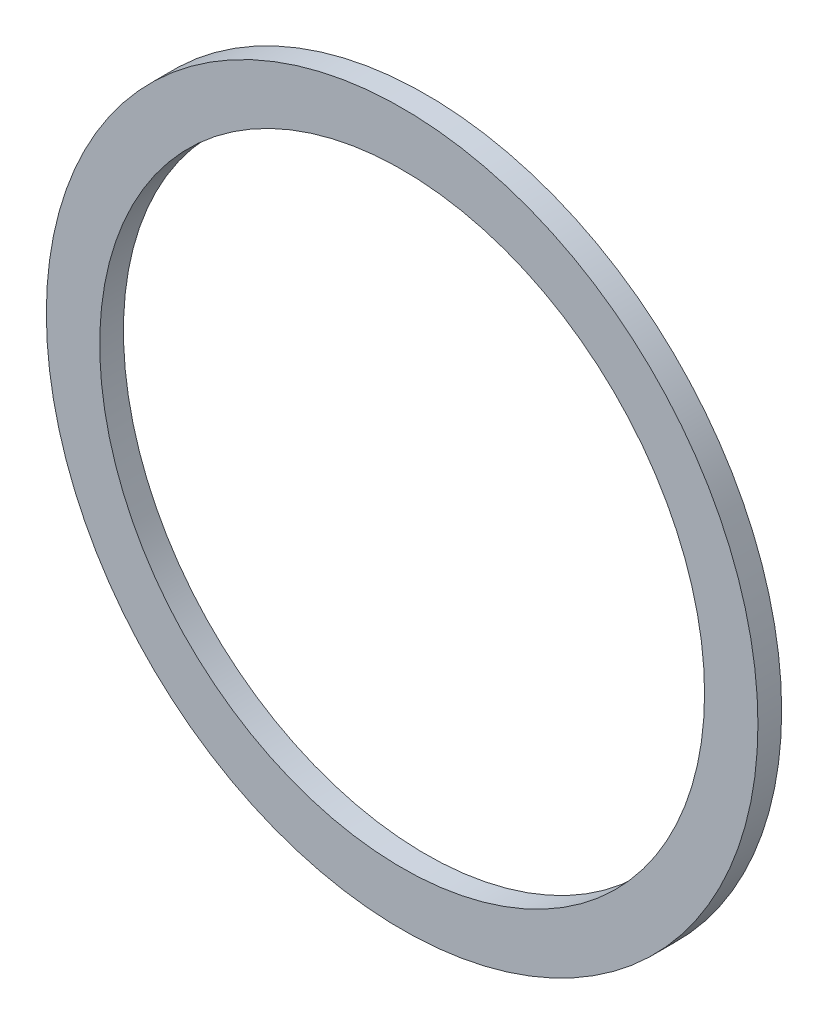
ISO-10303-21;
HEADER;
FILE_DESCRIPTION(('STEP AP214'),'2;1');
FILE_NAME('part.step','',(''),(''),'','','');
FILE_SCHEMA(('AUTOMOTIVE_DESIGN { 1 0 10303 214 1 1 1 1 }'));
ENDSEC;
DATA;
#1=APPLICATION_CONTEXT('core data for automotive mechanical design processes');
#2=APPLICATION_PROTOCOL_DEFINITION('international standard','automotive_design',2000,#1);
#3=PRODUCT_CONTEXT('',#1,'mechanical');
#4=PRODUCT('Part','Part','',(#3));
#5=PRODUCT_RELATED_PRODUCT_CATEGORY('part','',(#4));
#6=PRODUCT_DEFINITION_FORMATION('','',#4);
#7=PRODUCT_DEFINITION_CONTEXT('part definition',#1,'design');
#8=PRODUCT_DEFINITION('design','',#6,#7);
#9=PRODUCT_DEFINITION_SHAPE('','',#8);
#10=(LENGTH_UNIT() NAMED_UNIT(*) SI_UNIT(.MILLI.,.METRE.));
#11=(NAMED_UNIT(*) PLANE_ANGLE_UNIT() SI_UNIT($,.RADIAN.));
#12=(NAMED_UNIT(*) SI_UNIT($,.STERADIAN.) SOLID_ANGLE_UNIT());
#13=UNCERTAINTY_MEASURE_WITH_UNIT(LENGTH_MEASURE(1.E-05),#10,'distance_accuracy_value','');
#14=(GEOMETRIC_REPRESENTATION_CONTEXT(3) GLOBAL_UNCERTAINTY_ASSIGNED_CONTEXT((#13)) GLOBAL_UNIT_ASSIGNED_CONTEXT((#10,
#11,#12)) REPRESENTATION_CONTEXT('',''));
#15=CARTESIAN_POINT('',(0.,0.,0.));
#16=DIRECTION('',(0.,0.,1.));
#17=DIRECTION('',(1.,0.,0.));
#18=AXIS2_PLACEMENT_3D('',#15,#16,#17);
#19=CARTESIAN_POINT('',(0.,0.,2.));
#20=DIRECTION('',(0.,0.,1.));
#21=DIRECTION('',(1.,0.,0.));
#22=AXIS2_PLACEMENT_3D('',#19,#20,#21);
#23=PLANE('',#22);
#24=CARTESIAN_POINT('',(0.,0.,2.));
#25=DIRECTION('',(0.,0.,1.));
#26=DIRECTION('',(1.,0.,0.));
#27=AXIS2_PLACEMENT_3D('',#24,#25,#26);
#28=CIRCLE('',#27,30.);
#29=CARTESIAN_POINT('',(30.,0.,2.));
#30=VERTEX_POINT('',#29);
#31=EDGE_CURVE('E10',#30,#30,#28,.T.);
#32=ORIENTED_EDGE('',*,*,#31,.T.);
#33=EDGE_LOOP('',(#32));
#34=FACE_BOUND('',#33,.T.);
#35=CARTESIAN_POINT('',(0.,0.,2.));
#36=DIRECTION('',(0.,0.,1.));
#37=DIRECTION('',(1.,0.,0.));
#38=AXIS2_PLACEMENT_3D('',#35,#36,#37);
#39=CIRCLE('',#38,25.5);
#40=CARTESIAN_POINT('',(25.5,0.,2.));
#41=VERTEX_POINT('',#40);
#42=EDGE_CURVE('E42',#41,#41,#39,.T.);
#43=ORIENTED_EDGE('',*,*,#42,.F.);
#44=EDGE_LOOP('',(#43));
#45=FACE_BOUND('',#44,.T.);
#46=ADVANCED_FACE('F31',(#34,#45),#23,.T.);
#47=CARTESIAN_POINT('',(0.,0.,0.));
#48=DIRECTION('',(0.,0.,1.));
#49=DIRECTION('',(1.,0.,0.));
#50=AXIS2_PLACEMENT_3D('',#47,#48,#49);
#51=PLANE('',#50);
#52=CARTESIAN_POINT('',(0.,0.,0.));
#53=DIRECTION('',(0.,0.,1.));
#54=DIRECTION('',(1.,0.,0.));
#55=AXIS2_PLACEMENT_3D('',#52,#53,#54);
#56=CIRCLE('',#55,30.);
#57=CARTESIAN_POINT('',(30.,0.,0.));
#58=VERTEX_POINT('',#57);
#59=EDGE_CURVE('E35',#58,#58,#56,.T.);
#60=ORIENTED_EDGE('',*,*,#59,.F.);
#61=EDGE_LOOP('',(#60));
#62=FACE_BOUND('',#61,.T.);
#63=CARTESIAN_POINT('',(0.,0.,0.));
#64=DIRECTION('',(0.,0.,1.));
#65=DIRECTION('',(1.,0.,0.));
#66=AXIS2_PLACEMENT_3D('',#63,#64,#65);
#67=CIRCLE('',#66,25.5);
#68=CARTESIAN_POINT('',(25.5,0.,0.));
#69=VERTEX_POINT('',#68);
#70=EDGE_CURVE('E44',#69,#69,#67,.T.);
#71=ORIENTED_EDGE('',*,*,#70,.T.);
#72=EDGE_LOOP('',(#71));
#73=FACE_BOUND('',#72,.T.);
#74=ADVANCED_FACE('F54',(#62,#73),#51,.F.);
#75=CARTESIAN_POINT('',(0.,0.,2.));
#76=DIRECTION('',(0.,0.,-1.));
#77=DIRECTION('',(-1.,0.,0.));
#78=AXIS2_PLACEMENT_3D('',#75,#76,#77);
#79=CYLINDRICAL_SURFACE('',#78,30.);
#80=ORIENTED_EDGE('',*,*,#31,.F.);
#81=EDGE_LOOP('',(#80));
#82=FACE_BOUND('',#81,.T.);
#83=ORIENTED_EDGE('',*,*,#59,.T.);
#84=EDGE_LOOP('',(#83));
#85=FACE_BOUND('',#84,.T.);
#86=ADVANCED_FACE('F33',(#82,#85),#79,.T.);
#87=CARTESIAN_POINT('',(0.,0.,2.));
#88=DIRECTION('',(0.,0.,-1.));
#89=DIRECTION('',(-1.,0.,0.));
#90=AXIS2_PLACEMENT_3D('',#87,#88,#89);
#91=CYLINDRICAL_SURFACE('',#90,25.5);
#92=ORIENTED_EDGE('',*,*,#42,.T.);
#93=EDGE_LOOP('',(#92));
#94=FACE_BOUND('',#93,.T.);
#95=ORIENTED_EDGE('',*,*,#70,.F.);
#96=EDGE_LOOP('',(#95));
#97=FACE_BOUND('',#96,.T.);
#98=ADVANCED_FACE('F50',(#94,#97),#91,.F.);
#99=CLOSED_SHELL('',(#46,#74,#86,#98));
#100=MANIFOLD_SOLID_BREP('B2',#99);
#101=ADVANCED_BREP_SHAPE_REPRESENTATION('',(#18,#100),#14);
#102=SHAPE_DEFINITION_REPRESENTATION(#9,#101);
ENDSEC;
END-ISO-10303-21;
